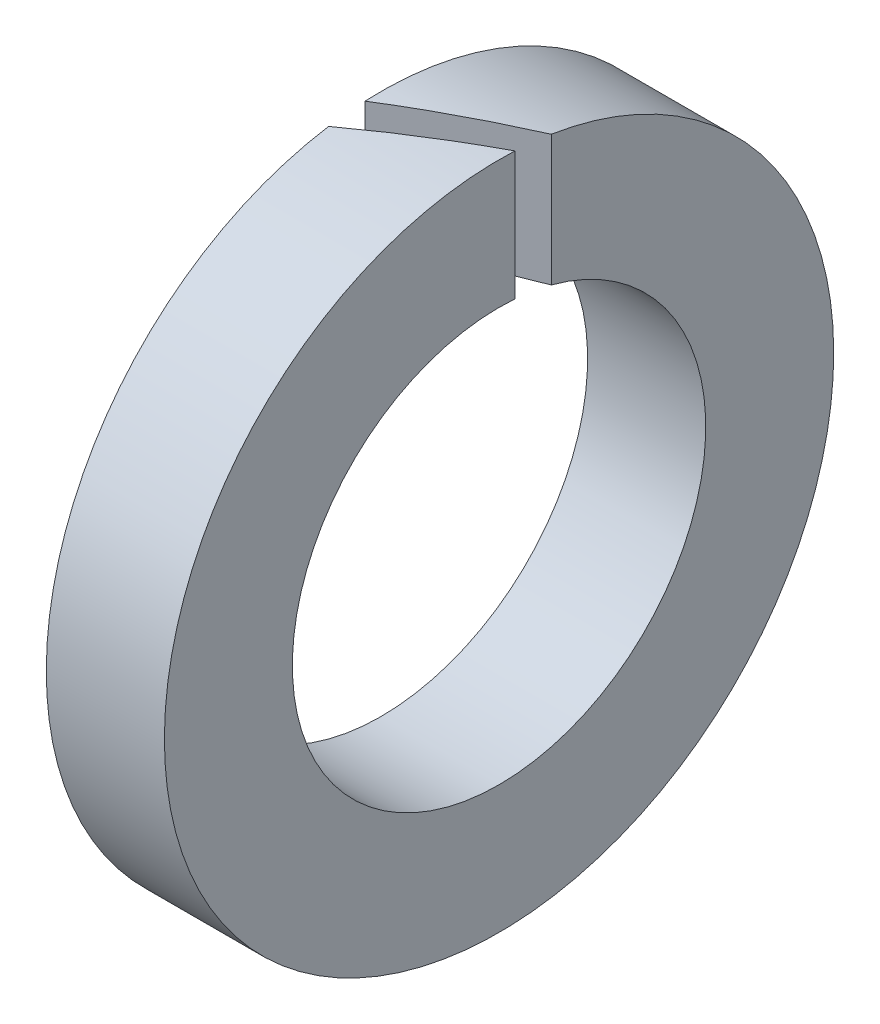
ISO-10303-21;
HEADER;
FILE_DESCRIPTION(('STEP AP214'),'2;1');
FILE_NAME('part.step','',(''),(''),'','','');
FILE_SCHEMA(('AUTOMOTIVE_DESIGN { 1 0 10303 214 1 1 1 1 }'));
ENDSEC;
DATA;
#1=APPLICATION_CONTEXT('core data for automotive mechanical design processes');
#2=APPLICATION_PROTOCOL_DEFINITION('international standard','automotive_design',2000,#1);
#3=PRODUCT_CONTEXT('',#1,'mechanical');
#4=PRODUCT('Part','Part','',(#3));
#5=PRODUCT_RELATED_PRODUCT_CATEGORY('part','',(#4));
#6=PRODUCT_DEFINITION_FORMATION('','',#4);
#7=PRODUCT_DEFINITION_CONTEXT('part definition',#1,'design');
#8=PRODUCT_DEFINITION('design','',#6,#7);
#9=PRODUCT_DEFINITION_SHAPE('','',#8);
#10=(LENGTH_UNIT() NAMED_UNIT(*) SI_UNIT(.MILLI.,.METRE.));
#11=(NAMED_UNIT(*) PLANE_ANGLE_UNIT() SI_UNIT($,.RADIAN.));
#12=(NAMED_UNIT(*) SI_UNIT($,.STERADIAN.) SOLID_ANGLE_UNIT());
#13=UNCERTAINTY_MEASURE_WITH_UNIT(LENGTH_MEASURE(1.E-05),#10,'distance_accuracy_value','');
#14=(GEOMETRIC_REPRESENTATION_CONTEXT(3) GLOBAL_UNCERTAINTY_ASSIGNED_CONTEXT((#13)) GLOBAL_UNIT_ASSIGNED_CONTEXT((#10,
#11,#12)) REPRESENTATION_CONTEXT('',''));
#15=CARTESIAN_POINT('',(0.,0.,0.));
#16=DIRECTION('',(0.,0.,1.));
#17=DIRECTION('',(1.,0.,0.));
#18=AXIS2_PLACEMENT_3D('',#15,#16,#17);
#19=CARTESIAN_POINT('',(2.99999999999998,0.,0.));
#20=DIRECTION('',(1.,0.,0.));
#21=DIRECTION('',(0.,0.,-1.));
#22=AXIS2_PLACEMENT_3D('',#19,#20,#21);
#23=PLANE('',#22);
#24=CARTESIAN_POINT('',(2.99999999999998,0.,0.));
#25=DIRECTION('',(1.,0.,0.));
#26=DIRECTION('',(0.,0.,-1.));
#27=AXIS2_PLACEMENT_3D('',#24,#25,#26);
#28=CIRCLE('',#27,8.5);
#29=CARTESIAN_POINT('',(2.99999999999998,8.49038687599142,-0.404141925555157));
#30=VERTEX_POINT('',#29);
#31=CARTESIAN_POINT('',(2.99999999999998,8.39563378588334,-1.32790561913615));
#32=VERTEX_POINT('',#31);
#33=EDGE_CURVE('E78',#30,#32,#28,.T.);
#34=ORIENTED_EDGE('',*,*,#33,.T.);
#35=DIRECTION('',(0.,-1.,0.));
#36=VECTOR('',#35,1.);
#37=CARTESIAN_POINT('',(2.99999999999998,0.,-1.32790561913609));
#38=LINE('',#37,#36);
#39=CARTESIAN_POINT('',(2.99999999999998,5.07928800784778,-1.32790561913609));
#40=VERTEX_POINT('',#39);
#41=EDGE_CURVE('E92',#32,#40,#38,.T.);
#42=ORIENTED_EDGE('',*,*,#41,.T.);
#43=CARTESIAN_POINT('',(2.99999999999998,0.,0.));
#44=DIRECTION('',(1.,0.,0.));
#45=DIRECTION('',(0.,0.,-1.));
#46=AXIS2_PLACEMENT_3D('',#43,#44,#45);
#47=CIRCLE('',#46,5.25);
#48=CARTESIAN_POINT('',(2.99999999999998,5.23442158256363,-0.404141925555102));
#49=VERTEX_POINT('',#48);
#50=EDGE_CURVE('E88',#49,#40,#47,.T.);
#51=ORIENTED_EDGE('',*,*,#50,.F.);
#52=DIRECTION('',(0.,1.,0.));
#53=VECTOR('',#52,1.);
#54=CARTESIAN_POINT('',(2.99999999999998,0.,-0.404141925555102));
#55=LINE('',#54,#53);
#56=EDGE_CURVE('E55',#49,#30,#55,.T.);
#57=ORIENTED_EDGE('',*,*,#56,.T.);
#58=EDGE_LOOP('',(#34,#42,#51,#57));
#59=FACE_BOUND('',#58,.T.);
#60=ADVANCED_FACE('F33',(#59),#23,.T.);
#61=CARTESIAN_POINT('',(0.,0.,0.));
#62=DIRECTION('',(1.,0.,0.));
#63=DIRECTION('',(0.,0.,-1.));
#64=AXIS2_PLACEMENT_3D('',#61,#62,#63);
#65=PLANE('',#64);
#66=DIRECTION('',(0.,-1.,0.));
#67=VECTOR('',#66,1.);
#68=CARTESIAN_POINT('',(0.,0.,0.404145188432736));
#69=LINE('',#68,#67);
#70=CARTESIAN_POINT('',(0.,8.49038672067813,0.404145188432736));
#71=VERTEX_POINT('',#70);
#72=CARTESIAN_POINT('',(0.,5.23442133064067,0.404145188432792));
#73=VERTEX_POINT('',#72);
#74=EDGE_CURVE('E48',#71,#73,#69,.T.);
#75=ORIENTED_EDGE('',*,*,#74,.F.);
#76=CARTESIAN_POINT('',(0.,0.,0.));
#77=DIRECTION('',(1.,0.,0.));
#78=DIRECTION('',(0.,0.,-1.));
#79=AXIS2_PLACEMENT_3D('',#76,#77,#78);
#80=CIRCLE('',#79,8.5);
#81=CARTESIAN_POINT('',(0.,8.39563326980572,1.32790888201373));
#82=VERTEX_POINT('',#81);
#83=EDGE_CURVE('E85',#82,#71,#80,.T.);
#84=ORIENTED_EDGE('',*,*,#83,.F.);
#85=DIRECTION('',(0.,1.,0.));
#86=VECTOR('',#85,1.);
#87=CARTESIAN_POINT('',(0.,0.,1.32790888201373));
#88=LINE('',#87,#86);
#89=CARTESIAN_POINT('',(0.,5.07928715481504,1.32790888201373));
#90=VERTEX_POINT('',#89);
#91=EDGE_CURVE('E72',#90,#82,#88,.T.);
#92=ORIENTED_EDGE('',*,*,#91,.F.);
#93=CARTESIAN_POINT('',(0.,0.,0.));
#94=DIRECTION('',(1.,0.,0.));
#95=DIRECTION('',(0.,0.,-1.));
#96=AXIS2_PLACEMENT_3D('',#93,#94,#95);
#97=CIRCLE('',#96,5.25);
#98=EDGE_CURVE('E83',#90,#73,#97,.T.);
#99=ORIENTED_EDGE('',*,*,#98,.T.);
#100=EDGE_LOOP('',(#75,#84,#92,#99));
#101=FACE_BOUND('',#100,.T.);
#102=ADVANCED_FACE('F82',(#101),#65,.F.);
#103=CARTESIAN_POINT('',(2.99999999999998,0.,0.));
#104=DIRECTION('',(-1.,0.,0.));
#105=DIRECTION('',(0.,0.,1.));
#106=AXIS2_PLACEMENT_3D('',#103,#104,#105);
#107=CYLINDRICAL_SURFACE('',#106,8.5);
#108=CARTESIAN_POINT('',(0.699999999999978,0.,0.));
#109=DIRECTION('',(0.5,0.,0.866025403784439));
#110=DIRECTION('',(-0.866025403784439,0.,0.5));
#111=AXIS2_PLACEMENT_3D('',#108,#109,#110);
#112=ELLIPSE('',#111,17.,8.5);
#113=EDGE_CURVE('E89',#32,#71,#112,.T.);
#114=ORIENTED_EDGE('',*,*,#113,.F.);
#115=ORIENTED_EDGE('',*,*,#33,.F.);
#116=CARTESIAN_POINT('',(2.30000565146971,0.,0.));
#117=DIRECTION('',(-0.5,0.,-0.866025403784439));
#118=DIRECTION('',(-0.866025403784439,0.,0.500000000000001));
#119=AXIS2_PLACEMENT_3D('',#116,#117,#118);
#120=ELLIPSE('',#119,17.,8.5);
#121=EDGE_CURVE('E103',#82,#30,#120,.T.);
#122=ORIENTED_EDGE('',*,*,#121,.F.);
#123=ORIENTED_EDGE('',*,*,#83,.T.);
#124=EDGE_LOOP('',(#114,#115,#122,#123));
#125=FACE_BOUND('',#124,.T.);
#126=ADVANCED_FACE('F35',(#125),#107,.T.);
#127=CARTESIAN_POINT('',(2.99999999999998,0.,0.));
#128=DIRECTION('',(-1.,0.,0.));
#129=DIRECTION('',(0.,0.,1.));
#130=AXIS2_PLACEMENT_3D('',#127,#128,#129);
#131=CYLINDRICAL_SURFACE('',#130,5.25);
#132=ORIENTED_EDGE('',*,*,#50,.T.);
#133=CARTESIAN_POINT('',(0.699999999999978,0.,0.));
#134=DIRECTION('',(0.5,0.,0.866025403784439));
#135=DIRECTION('',(-0.866025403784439,0.,0.5));
#136=AXIS2_PLACEMENT_3D('',#133,#134,#135);
#137=ELLIPSE('',#136,10.5,5.25);
#138=EDGE_CURVE('E11',#40,#73,#137,.T.);
#139=ORIENTED_EDGE('',*,*,#138,.T.);
#140=ORIENTED_EDGE('',*,*,#98,.F.);
#141=CARTESIAN_POINT('',(2.30000565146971,0.,0.));
#142=DIRECTION('',(-0.5,0.,-0.866025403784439));
#143=DIRECTION('',(-0.866025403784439,0.,0.500000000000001));
#144=AXIS2_PLACEMENT_3D('',#141,#142,#143);
#145=ELLIPSE('',#144,10.5,5.25);
#146=EDGE_CURVE('E41',#90,#49,#145,.T.);
#147=ORIENTED_EDGE('',*,*,#146,.T.);
#148=EDGE_LOOP('',(#132,#139,#140,#147));
#149=FACE_BOUND('',#148,.T.);
#150=ADVANCED_FACE('F87',(#149),#131,.F.);
#151=CARTESIAN_POINT('',(-0.0889807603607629,8.50000000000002,1.37928194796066));
#152=DIRECTION('',(-0.5,0.,-0.866025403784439));
#153=DIRECTION('',(-0.866025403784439,0.,0.500000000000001));
#154=AXIS2_PLACEMENT_3D('',#151,#152,#153);
#155=PLANE('',#154);
#156=ORIENTED_EDGE('',*,*,#121,.T.);
#157=ORIENTED_EDGE('',*,*,#56,.F.);
#158=ORIENTED_EDGE('',*,*,#146,.F.);
#159=ORIENTED_EDGE('',*,*,#91,.T.);
#160=EDGE_LOOP('',(#156,#157,#158,#159));
#161=FACE_BOUND('',#160,.T.);
#162=ADVANCED_FACE('F71',(#161),#155,.T.);
#163=CARTESIAN_POINT('',(-0.442762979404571,8.50000000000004,0.659774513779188));
#164=DIRECTION('',(0.5,0.,0.866025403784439));
#165=DIRECTION('',(0.866025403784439,0.,-0.5));
#166=AXIS2_PLACEMENT_3D('',#163,#164,#165);
#167=PLANE('',#166);
#168=ORIENTED_EDGE('',*,*,#113,.T.);
#169=ORIENTED_EDGE('',*,*,#74,.T.);
#170=ORIENTED_EDGE('',*,*,#138,.F.);
#171=ORIENTED_EDGE('',*,*,#41,.F.);
#172=EDGE_LOOP('',(#168,#169,#170,#171));
#173=FACE_BOUND('',#172,.T.);
#174=ADVANCED_FACE('F104',(#173),#167,.T.);
#175=CLOSED_SHELL('',(#60,#102,#126,#150,#162,#174));
#176=MANIFOLD_SOLID_BREP('B2',#175);
#177=ADVANCED_BREP_SHAPE_REPRESENTATION('',(#18,#176),#14);
#178=SHAPE_DEFINITION_REPRESENTATION(#9,#177);
ENDSEC;
END-ISO-10303-21;
